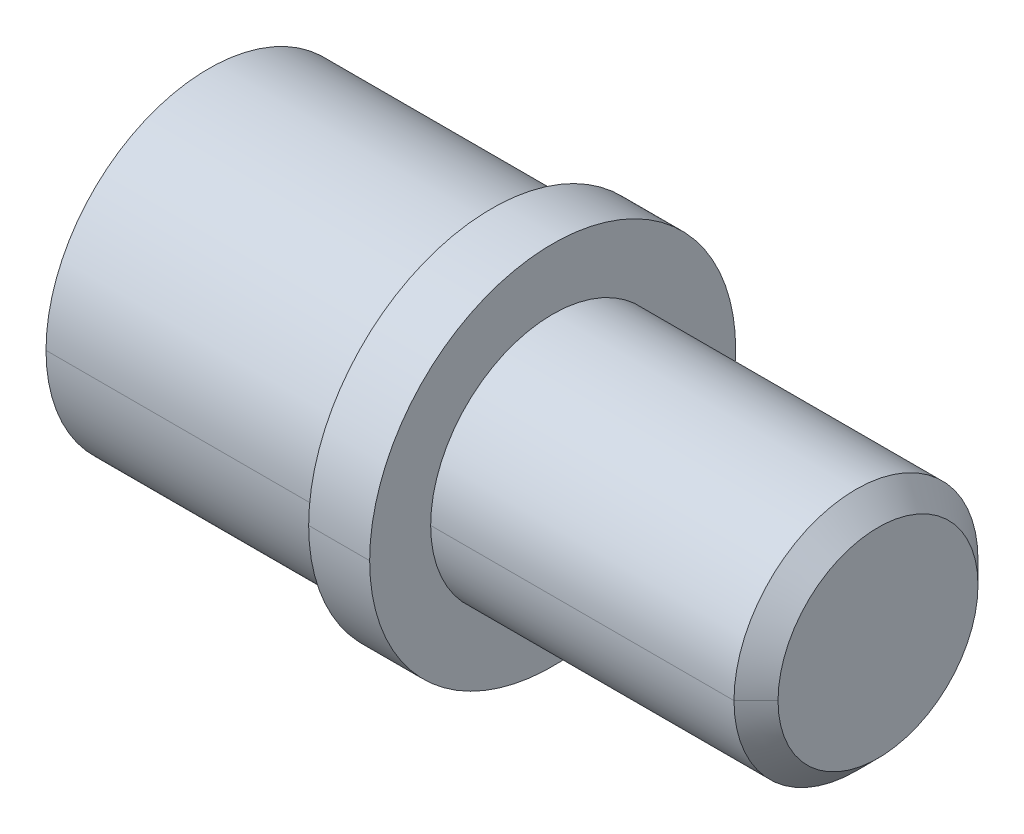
ISO-10303-21;
HEADER;
FILE_DESCRIPTION(('STEP AP214'),'2;1');
FILE_NAME('part.step','',(''),(''),'','','');
FILE_SCHEMA(('AUTOMOTIVE_DESIGN { 1 0 10303 214 1 1 1 1 }'));
ENDSEC;
DATA;
#1=APPLICATION_CONTEXT('core data for automotive mechanical design processes');
#2=APPLICATION_PROTOCOL_DEFINITION('international standard','automotive_design',2000,#1);
#3=PRODUCT_CONTEXT('',#1,'mechanical');
#4=PRODUCT('Part','Part','',(#3));
#5=PRODUCT_RELATED_PRODUCT_CATEGORY('part','',(#4));
#6=PRODUCT_DEFINITION_FORMATION('','',#4);
#7=PRODUCT_DEFINITION_CONTEXT('part definition',#1,'design');
#8=PRODUCT_DEFINITION('design','',#6,#7);
#9=PRODUCT_DEFINITION_SHAPE('','',#8);
#10=(LENGTH_UNIT() NAMED_UNIT(*) SI_UNIT(.MILLI.,.METRE.));
#11=(NAMED_UNIT(*) PLANE_ANGLE_UNIT() SI_UNIT($,.RADIAN.));
#12=(NAMED_UNIT(*) SI_UNIT($,.STERADIAN.) SOLID_ANGLE_UNIT());
#13=UNCERTAINTY_MEASURE_WITH_UNIT(LENGTH_MEASURE(1.E-05),#10,'distance_accuracy_value','');
#14=(GEOMETRIC_REPRESENTATION_CONTEXT(3) GLOBAL_UNCERTAINTY_ASSIGNED_CONTEXT((#13)) GLOBAL_UNIT_ASSIGNED_CONTEXT((#10,
#11,#12)) REPRESENTATION_CONTEXT('',''));
#15=CARTESIAN_POINT('',(0.,0.,0.));
#16=DIRECTION('',(0.,0.,1.));
#17=DIRECTION('',(1.,0.,0.));
#18=AXIS2_PLACEMENT_3D('',#15,#16,#17);
#19=CARTESIAN_POINT('',(-2.25,0.,0.));
#20=DIRECTION('',(-1.,0.,0.));
#21=DIRECTION('',(0.,1.,0.));
#22=AXIS2_PLACEMENT_3D('',#19,#20,#21);
#23=CONICAL_SURFACE('',#22,2.875,1.0471975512);
#24=DIRECTION('',(-0.499999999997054,0.,-0.86602540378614));
#25=VECTOR('',#24,1.);
#26=CARTESIAN_POINT('',(-0.590117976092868,0.,0.));
#27=LINE('',#26,#25);
#28=CARTESIAN_POINT('',(-0.59011797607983,0.,0.));
#29=VERTEX_POINT('',#28);
#30=CARTESIAN_POINT('',(-2.25,0.,-2.875));
#31=VERTEX_POINT('',#30);
#32=EDGE_CURVE('E11',#29,#31,#27,.T.);
#33=ORIENTED_EDGE('',*,*,#32,.T.);
#34=CARTESIAN_POINT('',(-2.25,0.,0.));
#35=DIRECTION('',(1.,0.,0.));
#36=DIRECTION('',(0.,0.,-1.));
#37=AXIS2_PLACEMENT_3D('',#34,#35,#36);
#38=CIRCLE('',#37,2.875);
#39=CARTESIAN_POINT('',(-2.25,-1.41972708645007,-2.5));
#40=VERTEX_POINT('',#39);
#41=EDGE_CURVE('E24',#40,#31,#38,.T.);
#42=ORIENTED_EDGE('',*,*,#41,.F.);
#43=CARTESIAN_POINT('',(-2.25,0.,0.));
#44=DIRECTION('',(1.,0.,0.));
#45=DIRECTION('',(0.,0.,-1.));
#46=AXIS2_PLACEMENT_3D('',#43,#44,#45);
#47=CIRCLE('',#46,2.875);
#48=CARTESIAN_POINT('',(-2.25,-1.45519996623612,-2.47951972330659));
#49=VERTEX_POINT('',#48);
#50=EDGE_CURVE('E518',#49,#40,#47,.T.);
#51=ORIENTED_EDGE('',*,*,#50,.F.);
#52=CARTESIAN_POINT('',(-2.25,0.,0.));
#53=DIRECTION('',(1.,0.,0.));
#54=DIRECTION('',(0.,0.,-1.));
#55=AXIS2_PLACEMENT_3D('',#52,#53,#54);
#56=CIRCLE('',#55,2.875);
#57=CARTESIAN_POINT('',(-2.25,-2.87492705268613,-0.0204802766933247));
#58=VERTEX_POINT('',#57);
#59=EDGE_CURVE('E513',#58,#49,#56,.T.);
#60=ORIENTED_EDGE('',*,*,#59,.F.);
#61=CARTESIAN_POINT('',(-2.25,0.,0.));
#62=DIRECTION('',(1.,0.,0.));
#63=DIRECTION('',(0.,0.,-1.));
#64=AXIS2_PLACEMENT_3D('',#61,#62,#63);
#65=CIRCLE('',#64,2.875);
#66=CARTESIAN_POINT('',(-2.25,-2.87492705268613,0.0204802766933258));
#67=VERTEX_POINT('',#66);
#68=EDGE_CURVE('E508',#67,#58,#65,.T.);
#69=ORIENTED_EDGE('',*,*,#68,.F.);
#70=CARTESIAN_POINT('',(-2.25,0.,0.));
#71=DIRECTION('',(1.,0.,0.));
#72=DIRECTION('',(0.,0.,-1.));
#73=AXIS2_PLACEMENT_3D('',#70,#71,#72);
#74=CIRCLE('',#73,2.875);
#75=CARTESIAN_POINT('',(-2.25,-1.45519996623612,2.47951972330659));
#76=VERTEX_POINT('',#75);
#77=EDGE_CURVE('E503',#76,#67,#74,.T.);
#78=ORIENTED_EDGE('',*,*,#77,.F.);
#79=CARTESIAN_POINT('',(-2.25,0.,0.));
#80=DIRECTION('',(1.,0.,0.));
#81=DIRECTION('',(0.,0.,-1.));
#82=AXIS2_PLACEMENT_3D('',#79,#80,#81);
#83=CIRCLE('',#82,2.875);
#84=CARTESIAN_POINT('',(-2.25,-1.41972708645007,2.5));
#85=VERTEX_POINT('',#84);
#86=EDGE_CURVE('E498',#85,#76,#83,.T.);
#87=ORIENTED_EDGE('',*,*,#86,.F.);
#88=CARTESIAN_POINT('',(-2.25,0.,0.));
#89=DIRECTION('',(1.,0.,0.));
#90=DIRECTION('',(0.,0.,-1.));
#91=AXIS2_PLACEMENT_3D('',#88,#89,#90);
#92=CIRCLE('',#91,2.875);
#93=CARTESIAN_POINT('',(-2.25,0.,2.875));
#94=VERTEX_POINT('',#93);
#95=EDGE_CURVE('E493',#94,#85,#92,.T.);
#96=ORIENTED_EDGE('',*,*,#95,.F.);
#97=DIRECTION('',(-0.499999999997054,0.,0.86602540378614));
#98=VECTOR('',#97,1.);
#99=CARTESIAN_POINT('',(-0.590117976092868,0.,0.));
#100=LINE('',#99,#98);
#101=EDGE_CURVE('E488',#29,#94,#100,.T.);
#102=ORIENTED_EDGE('',*,*,#101,.F.);
#103=EDGE_LOOP('',(#33,#42,#51,#60,#69,#78,#87,#96,#102));
#104=FACE_BOUND('',#103,.T.);
#105=ADVANCED_FACE('F16',(#104),#23,.F.);
#106=CARTESIAN_POINT('',(-2.25,0.,0.));
#107=DIRECTION('',(-1.,0.,0.));
#108=DIRECTION('',(0.,-1.,0.));
#109=AXIS2_PLACEMENT_3D('',#106,#107,#108);
#110=CONICAL_SURFACE('',#109,2.875,1.0471975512);
#111=ORIENTED_EDGE('',*,*,#101,.T.);
#112=CARTESIAN_POINT('',(-2.25,0.,0.));
#113=DIRECTION('',(1.,0.,0.));
#114=DIRECTION('',(0.,0.,-1.));
#115=AXIS2_PLACEMENT_3D('',#112,#113,#114);
#116=CIRCLE('',#115,2.875);
#117=CARTESIAN_POINT('',(-2.25,1.41972708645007,2.5));
#118=VERTEX_POINT('',#117);
#119=EDGE_CURVE('E483',#118,#94,#116,.T.);
#120=ORIENTED_EDGE('',*,*,#119,.F.);
#121=CARTESIAN_POINT('',(-2.25,0.,0.));
#122=DIRECTION('',(1.,0.,0.));
#123=DIRECTION('',(0.,0.,-1.));
#124=AXIS2_PLACEMENT_3D('',#121,#122,#123);
#125=CIRCLE('',#124,2.875);
#126=CARTESIAN_POINT('',(-2.25,1.45519996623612,2.47951972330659));
#127=VERTEX_POINT('',#126);
#128=EDGE_CURVE('E478',#127,#118,#125,.T.);
#129=ORIENTED_EDGE('',*,*,#128,.F.);
#130=CARTESIAN_POINT('',(-2.25,0.,0.));
#131=DIRECTION('',(1.,0.,0.));
#132=DIRECTION('',(0.,0.,-1.));
#133=AXIS2_PLACEMENT_3D('',#130,#131,#132);
#134=CIRCLE('',#133,2.875);
#135=CARTESIAN_POINT('',(-2.25,2.87492705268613,0.0204802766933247));
#136=VERTEX_POINT('',#135);
#137=EDGE_CURVE('E473',#136,#127,#134,.T.);
#138=ORIENTED_EDGE('',*,*,#137,.F.);
#139=CARTESIAN_POINT('',(-2.25,0.,0.));
#140=DIRECTION('',(1.,0.,0.));
#141=DIRECTION('',(0.,0.,-1.));
#142=AXIS2_PLACEMENT_3D('',#139,#140,#141);
#143=CIRCLE('',#142,2.875);
#144=CARTESIAN_POINT('',(-2.25,2.87492705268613,-0.0204802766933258));
#145=VERTEX_POINT('',#144);
#146=EDGE_CURVE('E468',#145,#136,#143,.T.);
#147=ORIENTED_EDGE('',*,*,#146,.F.);
#148=CARTESIAN_POINT('',(-2.25,0.,0.));
#149=DIRECTION('',(1.,0.,0.));
#150=DIRECTION('',(0.,0.,-1.));
#151=AXIS2_PLACEMENT_3D('',#148,#149,#150);
#152=CIRCLE('',#151,2.875);
#153=CARTESIAN_POINT('',(-2.25,1.45519996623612,-2.47951972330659));
#154=VERTEX_POINT('',#153);
#155=EDGE_CURVE('E463',#154,#145,#152,.T.);
#156=ORIENTED_EDGE('',*,*,#155,.F.);
#157=CARTESIAN_POINT('',(-2.25,0.,0.));
#158=DIRECTION('',(1.,0.,0.));
#159=DIRECTION('',(0.,0.,-1.));
#160=AXIS2_PLACEMENT_3D('',#157,#158,#159);
#161=CIRCLE('',#160,2.875);
#162=CARTESIAN_POINT('',(-2.25,1.41972708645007,-2.5));
#163=VERTEX_POINT('',#162);
#164=EDGE_CURVE('E458',#163,#154,#161,.T.);
#165=ORIENTED_EDGE('',*,*,#164,.F.);
#166=CARTESIAN_POINT('',(-2.25,0.,0.));
#167=DIRECTION('',(1.,0.,0.));
#168=DIRECTION('',(0.,0.,-1.));
#169=AXIS2_PLACEMENT_3D('',#166,#167,#168);
#170=CIRCLE('',#169,2.875);
#171=EDGE_CURVE('E453',#31,#163,#170,.T.);
#172=ORIENTED_EDGE('',*,*,#171,.F.);
#173=ORIENTED_EDGE('',*,*,#32,.F.);
#174=EDGE_LOOP('',(#111,#120,#129,#138,#147,#156,#165,#172,#173));
#175=FACE_BOUND('',#174,.T.);
#176=ADVANCED_FACE('F567',(#175),#110,.F.);
#177=CARTESIAN_POINT('',(-2.25,0.,0.));
#178=DIRECTION('',(1.,0.,0.));
#179=DIRECTION('',(0.,0.,-1.));
#180=AXIS2_PLACEMENT_3D('',#177,#178,#179);
#181=PLANE('',#180);
#182=ORIENTED_EDGE('',*,*,#41,.T.);
#183=ORIENTED_EDGE('',*,*,#171,.T.);
#184=DIRECTION('',(0.,1.,0.));
#185=VECTOR('',#184,1.);
#186=CARTESIAN_POINT('',(-2.25,-1.4433756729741,-2.5));
#187=LINE('',#186,#185);
#188=EDGE_CURVE('E448',#40,#163,#187,.T.);
#189=ORIENTED_EDGE('',*,*,#188,.F.);
#190=EDGE_LOOP('',(#182,#183,#189));
#191=FACE_BOUND('',#190,.T.);
#192=ADVANCED_FACE('F528',(#191),#181,.T.);
#193=CARTESIAN_POINT('',(-2.25,-1.4433756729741,-2.5));
#194=DIRECTION('',(0.,0.,1.));
#195=DIRECTION('',(1.,0.,0.));
#196=AXIS2_PLACEMENT_3D('',#193,#194,#195);
#197=PLANE('',#196);
#198=DIRECTION('',(0.,-1.,0.));
#199=VECTOR('',#198,1.);
#200=CARTESIAN_POINT('',(-3.6,0.,-2.5));
#201=LINE('',#200,#199);
#202=CARTESIAN_POINT('',(-3.6,1.4433756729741,-2.5));
#203=VERTEX_POINT('',#202);
#204=CARTESIAN_POINT('',(-3.6,-1.4433756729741,-2.5));
#205=VERTEX_POINT('',#204);
#206=EDGE_CURVE('E444',#203,#205,#201,.T.);
#207=ORIENTED_EDGE('',*,*,#206,.T.);
#208=DIRECTION('',(-1.,0.,0.));
#209=VECTOR('',#208,1.);
#210=CARTESIAN_POINT('',(-2.25,-1.4433756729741,-2.5));
#211=LINE('',#210,#209);
#212=CARTESIAN_POINT('',(-2.25,-1.4433756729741,-2.5));
#213=VERTEX_POINT('',#212);
#214=EDGE_CURVE('E439',#213,#205,#211,.T.);
#215=ORIENTED_EDGE('',*,*,#214,.F.);
#216=DIRECTION('',(0.,1.,0.));
#217=VECTOR('',#216,1.);
#218=CARTESIAN_POINT('',(-2.25,-1.4433756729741,-2.5));
#219=LINE('',#218,#217);
#220=EDGE_CURVE('E434',#213,#40,#219,.T.);
#221=ORIENTED_EDGE('',*,*,#220,.T.);
#222=ORIENTED_EDGE('',*,*,#188,.T.);
#223=DIRECTION('',(0.,1.,0.));
#224=VECTOR('',#223,1.);
#225=CARTESIAN_POINT('',(-2.25,-1.4433756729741,-2.5));
#226=LINE('',#225,#224);
#227=CARTESIAN_POINT('',(-2.25,1.4433756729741,-2.5));
#228=VERTEX_POINT('',#227);
#229=EDGE_CURVE('E430',#163,#228,#226,.T.);
#230=ORIENTED_EDGE('',*,*,#229,.T.);
#231=DIRECTION('',(-1.,0.,0.));
#232=VECTOR('',#231,1.);
#233=CARTESIAN_POINT('',(-2.25,1.4433756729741,-2.5));
#234=LINE('',#233,#232);
#235=EDGE_CURVE('E426',#228,#203,#234,.T.);
#236=ORIENTED_EDGE('',*,*,#235,.T.);
#237=EDGE_LOOP('',(#207,#215,#221,#222,#230,#236));
#238=FACE_BOUND('',#237,.T.);
#239=ADVANCED_FACE('F532',(#238),#197,.T.);
#240=CARTESIAN_POINT('',(-2.25,1.4433756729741,-2.5));
#241=DIRECTION('',(0.,-0.866025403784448,0.499999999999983));
#242=DIRECTION('',(0.,-0.499999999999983,-0.866025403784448));
#243=AXIS2_PLACEMENT_3D('',#240,#241,#242);
#244=PLANE('',#243);
#245=DIRECTION('',(0.,-0.499999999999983,-0.866025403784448));
#246=VECTOR('',#245,1.);
#247=CARTESIAN_POINT('',(-3.6,2.16506350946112,-1.24999999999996));
#248=LINE('',#247,#246);
#249=CARTESIAN_POINT('',(-3.6,2.8867513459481,0.));
#250=VERTEX_POINT('',#249);
#251=EDGE_CURVE('E421',#250,#203,#248,.T.);
#252=ORIENTED_EDGE('',*,*,#251,.T.);
#253=ORIENTED_EDGE('',*,*,#235,.F.);
#254=DIRECTION('',(0.,0.499999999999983,0.866025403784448));
#255=VECTOR('',#254,1.);
#256=CARTESIAN_POINT('',(-2.25,1.4433756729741,-2.5));
#257=LINE('',#256,#255);
#258=EDGE_CURVE('E416',#228,#154,#257,.T.);
#259=ORIENTED_EDGE('',*,*,#258,.T.);
#260=DIRECTION('',(0.,0.499999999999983,0.866025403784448));
#261=VECTOR('',#260,1.);
#262=CARTESIAN_POINT('',(-2.25,1.4433756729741,-2.5));
#263=LINE('',#262,#261);
#264=EDGE_CURVE('E411',#154,#145,#263,.T.);
#265=ORIENTED_EDGE('',*,*,#264,.T.);
#266=DIRECTION('',(0.,0.499999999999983,0.866025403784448));
#267=VECTOR('',#266,1.);
#268=CARTESIAN_POINT('',(-2.25,1.4433756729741,-2.5));
#269=LINE('',#268,#267);
#270=CARTESIAN_POINT('',(-2.25,2.8867513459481,0.));
#271=VERTEX_POINT('',#270);
#272=EDGE_CURVE('E407',#145,#271,#269,.T.);
#273=ORIENTED_EDGE('',*,*,#272,.T.);
#274=DIRECTION('',(-1.,0.,0.));
#275=VECTOR('',#274,1.);
#276=CARTESIAN_POINT('',(-2.25,2.8867513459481,0.));
#277=LINE('',#276,#275);
#278=EDGE_CURVE('E403',#271,#250,#277,.T.);
#279=ORIENTED_EDGE('',*,*,#278,.T.);
#280=EDGE_LOOP('',(#252,#253,#259,#265,#273,#279));
#281=FACE_BOUND('',#280,.T.);
#282=ADVANCED_FACE('F580',(#281),#244,.T.);
#283=CARTESIAN_POINT('',(-2.25,2.8867513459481,0.));
#284=DIRECTION('',(0.,-0.866025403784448,-0.499999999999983));
#285=DIRECTION('',(0.,0.499999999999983,-0.866025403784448));
#286=AXIS2_PLACEMENT_3D('',#283,#284,#285);
#287=PLANE('',#286);
#288=DIRECTION('',(0.,0.499999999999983,-0.866025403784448));
#289=VECTOR('',#288,1.);
#290=CARTESIAN_POINT('',(-3.6,2.16506350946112,1.24999999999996));
#291=LINE('',#290,#289);
#292=CARTESIAN_POINT('',(-3.6,1.4433756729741,2.5));
#293=VERTEX_POINT('',#292);
#294=EDGE_CURVE('E398',#293,#250,#291,.T.);
#295=ORIENTED_EDGE('',*,*,#294,.T.);
#296=ORIENTED_EDGE('',*,*,#278,.F.);
#297=DIRECTION('',(0.,-0.499999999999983,0.866025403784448));
#298=VECTOR('',#297,1.);
#299=CARTESIAN_POINT('',(-2.25,2.8867513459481,0.));
#300=LINE('',#299,#298);
#301=EDGE_CURVE('E393',#271,#136,#300,.T.);
#302=ORIENTED_EDGE('',*,*,#301,.T.);
#303=DIRECTION('',(0.,-0.499999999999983,0.866025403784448));
#304=VECTOR('',#303,1.);
#305=CARTESIAN_POINT('',(-2.25,2.8867513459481,0.));
#306=LINE('',#305,#304);
#307=EDGE_CURVE('E388',#136,#127,#306,.T.);
#308=ORIENTED_EDGE('',*,*,#307,.T.);
#309=DIRECTION('',(0.,-0.499999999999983,0.866025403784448));
#310=VECTOR('',#309,1.);
#311=CARTESIAN_POINT('',(-2.25,2.8867513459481,0.));
#312=LINE('',#311,#310);
#313=CARTESIAN_POINT('',(-2.25,1.4433756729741,2.5));
#314=VERTEX_POINT('',#313);
#315=EDGE_CURVE('E384',#127,#314,#312,.T.);
#316=ORIENTED_EDGE('',*,*,#315,.T.);
#317=DIRECTION('',(-1.,0.,0.));
#318=VECTOR('',#317,1.);
#319=CARTESIAN_POINT('',(-2.25,1.4433756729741,2.5));
#320=LINE('',#319,#318);
#321=EDGE_CURVE('E380',#314,#293,#320,.T.);
#322=ORIENTED_EDGE('',*,*,#321,.T.);
#323=EDGE_LOOP('',(#295,#296,#302,#308,#316,#322));
#324=FACE_BOUND('',#323,.T.);
#325=ADVANCED_FACE('F570',(#324),#287,.T.);
#326=CARTESIAN_POINT('',(-2.25,1.4433756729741,2.5));
#327=DIRECTION('',(0.,0.,-1.));
#328=DIRECTION('',(-1.,0.,0.));
#329=AXIS2_PLACEMENT_3D('',#326,#327,#328);
#330=PLANE('',#329);
#331=DIRECTION('',(0.,1.,0.));
#332=VECTOR('',#331,1.);
#333=CARTESIAN_POINT('',(-3.6,0.,2.5));
#334=LINE('',#333,#332);
#335=CARTESIAN_POINT('',(-3.6,-1.4433756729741,2.5));
#336=VERTEX_POINT('',#335);
#337=EDGE_CURVE('E375',#336,#293,#334,.T.);
#338=ORIENTED_EDGE('',*,*,#337,.T.);
#339=ORIENTED_EDGE('',*,*,#321,.F.);
#340=DIRECTION('',(0.,-1.,0.));
#341=VECTOR('',#340,1.);
#342=CARTESIAN_POINT('',(-2.25,1.4433756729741,2.5));
#343=LINE('',#342,#341);
#344=EDGE_CURVE('E370',#314,#118,#343,.T.);
#345=ORIENTED_EDGE('',*,*,#344,.T.);
#346=DIRECTION('',(0.,-1.,0.));
#347=VECTOR('',#346,1.);
#348=CARTESIAN_POINT('',(-2.25,1.4433756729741,2.5));
#349=LINE('',#348,#347);
#350=EDGE_CURVE('E365',#118,#85,#349,.T.);
#351=ORIENTED_EDGE('',*,*,#350,.T.);
#352=DIRECTION('',(0.,-1.,0.));
#353=VECTOR('',#352,1.);
#354=CARTESIAN_POINT('',(-2.25,1.4433756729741,2.5));
#355=LINE('',#354,#353);
#356=CARTESIAN_POINT('',(-2.25,-1.4433756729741,2.5));
#357=VERTEX_POINT('',#356);
#358=EDGE_CURVE('E361',#85,#357,#355,.T.);
#359=ORIENTED_EDGE('',*,*,#358,.T.);
#360=DIRECTION('',(-1.,0.,0.));
#361=VECTOR('',#360,1.);
#362=CARTESIAN_POINT('',(-2.25,-1.4433756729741,2.5));
#363=LINE('',#362,#361);
#364=EDGE_CURVE('E357',#357,#336,#363,.T.);
#365=ORIENTED_EDGE('',*,*,#364,.T.);
#366=EDGE_LOOP('',(#338,#339,#345,#351,#359,#365));
#367=FACE_BOUND('',#366,.T.);
#368=ADVANCED_FACE('F558',(#367),#330,.T.);
#369=CARTESIAN_POINT('',(-2.25,-1.4433756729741,2.5));
#370=DIRECTION('',(0.,0.866025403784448,-0.499999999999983));
#371=DIRECTION('',(0.,0.499999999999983,0.866025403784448));
#372=AXIS2_PLACEMENT_3D('',#369,#370,#371);
#373=PLANE('',#372);
#374=DIRECTION('',(0.,0.499999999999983,0.866025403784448));
#375=VECTOR('',#374,1.);
#376=CARTESIAN_POINT('',(-3.6,-2.16506350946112,1.24999999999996));
#377=LINE('',#376,#375);
#378=CARTESIAN_POINT('',(-3.6,-2.8867513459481,0.));
#379=VERTEX_POINT('',#378);
#380=EDGE_CURVE('E352',#379,#336,#377,.T.);
#381=ORIENTED_EDGE('',*,*,#380,.T.);
#382=ORIENTED_EDGE('',*,*,#364,.F.);
#383=DIRECTION('',(0.,-0.499999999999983,-0.866025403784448));
#384=VECTOR('',#383,1.);
#385=CARTESIAN_POINT('',(-2.25,-1.4433756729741,2.5));
#386=LINE('',#385,#384);
#387=EDGE_CURVE('E347',#357,#76,#386,.T.);
#388=ORIENTED_EDGE('',*,*,#387,.T.);
#389=DIRECTION('',(0.,-0.499999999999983,-0.866025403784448));
#390=VECTOR('',#389,1.);
#391=CARTESIAN_POINT('',(-2.25,-1.4433756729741,2.5));
#392=LINE('',#391,#390);
#393=EDGE_CURVE('E342',#76,#67,#392,.T.);
#394=ORIENTED_EDGE('',*,*,#393,.T.);
#395=DIRECTION('',(0.,-0.499999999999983,-0.866025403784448));
#396=VECTOR('',#395,1.);
#397=CARTESIAN_POINT('',(-2.25,-1.4433756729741,2.5));
#398=LINE('',#397,#396);
#399=CARTESIAN_POINT('',(-2.25,-2.8867513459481,0.));
#400=VERTEX_POINT('',#399);
#401=EDGE_CURVE('E338',#67,#400,#398,.T.);
#402=ORIENTED_EDGE('',*,*,#401,.T.);
#403=DIRECTION('',(-1.,0.,0.));
#404=VECTOR('',#403,1.);
#405=CARTESIAN_POINT('',(-2.25,-2.8867513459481,0.));
#406=LINE('',#405,#404);
#407=EDGE_CURVE('E334',#400,#379,#406,.T.);
#408=ORIENTED_EDGE('',*,*,#407,.T.);
#409=EDGE_LOOP('',(#381,#382,#388,#394,#402,#408));
#410=FACE_BOUND('',#409,.T.);
#411=ADVANCED_FACE('F548',(#410),#373,.T.);
#412=CARTESIAN_POINT('',(-2.25,-2.8867513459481,0.));
#413=DIRECTION('',(0.,0.866025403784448,0.499999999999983));
#414=DIRECTION('',(0.,-0.499999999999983,0.866025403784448));
#415=AXIS2_PLACEMENT_3D('',#412,#413,#414);
#416=PLANE('',#415);
#417=DIRECTION('',(0.,-0.499999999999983,0.866025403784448));
#418=VECTOR('',#417,1.);
#419=CARTESIAN_POINT('',(-3.6,-2.16506350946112,-1.24999999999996));
#420=LINE('',#419,#418);
#421=EDGE_CURVE('E329',#205,#379,#420,.T.);
#422=ORIENTED_EDGE('',*,*,#421,.T.);
#423=ORIENTED_EDGE('',*,*,#407,.F.);
#424=DIRECTION('',(0.,0.499999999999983,-0.866025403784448));
#425=VECTOR('',#424,1.);
#426=CARTESIAN_POINT('',(-2.25,-2.8867513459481,0.));
#427=LINE('',#426,#425);
#428=EDGE_CURVE('E324',#400,#58,#427,.T.);
#429=ORIENTED_EDGE('',*,*,#428,.T.);
#430=DIRECTION('',(0.,0.499999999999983,-0.866025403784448));
#431=VECTOR('',#430,1.);
#432=CARTESIAN_POINT('',(-2.25,-2.8867513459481,0.));
#433=LINE('',#432,#431);
#434=EDGE_CURVE('E319',#58,#49,#433,.T.);
#435=ORIENTED_EDGE('',*,*,#434,.T.);
#436=DIRECTION('',(0.,0.499999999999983,-0.866025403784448));
#437=VECTOR('',#436,1.);
#438=CARTESIAN_POINT('',(-2.25,-2.8867513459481,0.));
#439=LINE('',#438,#437);
#440=EDGE_CURVE('E314',#49,#213,#439,.T.);
#441=ORIENTED_EDGE('',*,*,#440,.T.);
#442=ORIENTED_EDGE('',*,*,#214,.T.);
#443=EDGE_LOOP('',(#422,#423,#429,#435,#441,#442));
#444=FACE_BOUND('',#443,.T.);
#445=ADVANCED_FACE('F538',(#444),#416,.T.);
#446=CARTESIAN_POINT('',(-2.25,0.,0.));
#447=DIRECTION('',(1.,0.,0.));
#448=DIRECTION('',(0.,0.,-1.));
#449=AXIS2_PLACEMENT_3D('',#446,#447,#448);
#450=PLANE('',#449);
#451=ORIENTED_EDGE('',*,*,#50,.T.);
#452=ORIENTED_EDGE('',*,*,#220,.F.);
#453=ORIENTED_EDGE('',*,*,#440,.F.);
#454=EDGE_LOOP('',(#451,#452,#453));
#455=FACE_BOUND('',#454,.T.);
#456=ADVANCED_FACE('F535',(#455),#450,.F.);
#457=CARTESIAN_POINT('',(-2.25,0.,0.));
#458=DIRECTION('',(1.,0.,0.));
#459=DIRECTION('',(0.,0.,-1.));
#460=AXIS2_PLACEMENT_3D('',#457,#458,#459);
#461=PLANE('',#460);
#462=ORIENTED_EDGE('',*,*,#59,.T.);
#463=ORIENTED_EDGE('',*,*,#434,.F.);
#464=EDGE_LOOP('',(#462,#463));
#465=FACE_BOUND('',#464,.T.);
#466=ADVANCED_FACE('F542',(#465),#461,.T.);
#467=CARTESIAN_POINT('',(-2.25,0.,0.));
#468=DIRECTION('',(1.,0.,0.));
#469=DIRECTION('',(0.,0.,-1.));
#470=AXIS2_PLACEMENT_3D('',#467,#468,#469);
#471=PLANE('',#470);
#472=ORIENTED_EDGE('',*,*,#68,.T.);
#473=ORIENTED_EDGE('',*,*,#428,.F.);
#474=ORIENTED_EDGE('',*,*,#401,.F.);
#475=EDGE_LOOP('',(#472,#473,#474));
#476=FACE_BOUND('',#475,.T.);
#477=ADVANCED_FACE('F545',(#476),#471,.F.);
#478=CARTESIAN_POINT('',(-3.6,0.,0.));
#479=DIRECTION('',(1.,0.,0.));
#480=DIRECTION('',(0.,0.,-1.));
#481=AXIS2_PLACEMENT_3D('',#478,#479,#480);
#482=PLANE('',#481);
#483=CARTESIAN_POINT('',(-3.6,0.,0.));
#484=DIRECTION('',(1.,0.,0.));
#485=DIRECTION('',(0.,0.,-1.));
#486=AXIS2_PLACEMENT_3D('',#483,#484,#485);
#487=CIRCLE('',#486,3.5);
#488=CARTESIAN_POINT('',(-3.6,0.,-3.5));
#489=VERTEX_POINT('',#488);
#490=CARTESIAN_POINT('',(-3.6,0.,3.5));
#491=VERTEX_POINT('',#490);
#492=EDGE_CURVE('E309',#489,#491,#487,.T.);
#493=ORIENTED_EDGE('',*,*,#492,.F.);
#494=CARTESIAN_POINT('',(-3.6,0.,0.));
#495=DIRECTION('',(1.,0.,0.));
#496=DIRECTION('',(0.,0.,-1.));
#497=AXIS2_PLACEMENT_3D('',#494,#495,#496);
#498=CIRCLE('',#497,3.5);
#499=EDGE_CURVE('E304',#491,#489,#498,.T.);
#500=ORIENTED_EDGE('',*,*,#499,.F.);
#501=EDGE_LOOP('',(#493,#500));
#502=FACE_BOUND('',#501,.T.);
#503=ORIENTED_EDGE('',*,*,#337,.F.);
#504=ORIENTED_EDGE('',*,*,#380,.F.);
#505=ORIENTED_EDGE('',*,*,#421,.F.);
#506=ORIENTED_EDGE('',*,*,#206,.F.);
#507=ORIENTED_EDGE('',*,*,#251,.F.);
#508=ORIENTED_EDGE('',*,*,#294,.F.);
#509=EDGE_LOOP('',(#503,#504,#505,#506,#507,#508));
#510=FACE_BOUND('',#509,.T.);
#511=ADVANCED_FACE('F593',(#502,#510),#482,.F.);
#512=CARTESIAN_POINT('',(13.,0.,0.));
#513=DIRECTION('',(-1.,0.,0.));
#514=DIRECTION('',(0.,1.,0.));
#515=AXIS2_PLACEMENT_3D('',#512,#513,#514);
#516=CYLINDRICAL_SURFACE('',#515,3.5);
#517=ORIENTED_EDGE('',*,*,#499,.T.);
#518=DIRECTION('',(-1.,0.,0.));
#519=VECTOR('',#518,1.);
#520=CARTESIAN_POINT('',(-3.25,0.,-3.5));
#521=LINE('',#520,#519);
#522=CARTESIAN_POINT('',(-3.25,0.,-3.5));
#523=VERTEX_POINT('',#522);
#524=EDGE_CURVE('E299',#523,#489,#521,.T.);
#525=ORIENTED_EDGE('',*,*,#524,.F.);
#526=CARTESIAN_POINT('',(-3.25,0.,0.));
#527=DIRECTION('',(1.,0.,0.));
#528=DIRECTION('',(0.,0.,-1.));
#529=AXIS2_PLACEMENT_3D('',#526,#527,#528);
#530=CIRCLE('',#529,3.5);
#531=CARTESIAN_POINT('',(-3.25,0.,3.5));
#532=VERTEX_POINT('',#531);
#533=EDGE_CURVE('E294',#532,#523,#530,.T.);
#534=ORIENTED_EDGE('',*,*,#533,.F.);
#535=DIRECTION('',(-1.,0.,0.));
#536=VECTOR('',#535,1.);
#537=CARTESIAN_POINT('',(-3.25,0.,3.5));
#538=LINE('',#537,#536);
#539=EDGE_CURVE('E289',#532,#491,#538,.T.);
#540=ORIENTED_EDGE('',*,*,#539,.T.);
#541=EDGE_LOOP('',(#517,#525,#534,#540));
#542=FACE_BOUND('',#541,.T.);
#543=ADVANCED_FACE('F596',(#542),#516,.T.);
#544=CARTESIAN_POINT('',(13.,0.,0.));
#545=DIRECTION('',(-1.,0.,0.));
#546=DIRECTION('',(0.,-1.,0.));
#547=AXIS2_PLACEMENT_3D('',#544,#545,#546);
#548=CYLINDRICAL_SURFACE('',#547,3.5);
#549=CARTESIAN_POINT('',(-3.25,0.,0.));
#550=DIRECTION('',(1.,0.,0.));
#551=DIRECTION('',(0.,0.,-1.));
#552=AXIS2_PLACEMENT_3D('',#549,#550,#551);
#553=CIRCLE('',#552,3.5);
#554=EDGE_CURVE('E284',#523,#532,#553,.T.);
#555=ORIENTED_EDGE('',*,*,#554,.F.);
#556=ORIENTED_EDGE('',*,*,#524,.T.);
#557=ORIENTED_EDGE('',*,*,#492,.T.);
#558=ORIENTED_EDGE('',*,*,#539,.F.);
#559=EDGE_LOOP('',(#555,#556,#557,#558));
#560=FACE_BOUND('',#559,.T.);
#561=ADVANCED_FACE('F604',(#560),#548,.T.);
#562=CARTESIAN_POINT('',(-3.25,0.,0.));
#563=DIRECTION('',(-1.,0.,0.));
#564=DIRECTION('',(0.,-1.,0.));
#565=AXIS2_PLACEMENT_3D('',#562,#563,#564);
#566=CONICAL_SURFACE('',#565,3.5,1.1760052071);
#567=ORIENTED_EDGE('',*,*,#554,.T.);
#568=DIRECTION('',(-0.384615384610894,0.,0.923076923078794));
#569=VECTOR('',#568,1.);
#570=CARTESIAN_POINT('',(-3.25,0.,3.5));
#571=LINE('',#570,#569);
#572=CARTESIAN_POINT('',(-3.4583333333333,0.,4.));
#573=VERTEX_POINT('',#572);
#574=EDGE_CURVE('E280',#532,#573,#571,.T.);
#575=ORIENTED_EDGE('',*,*,#574,.T.);
#576=CARTESIAN_POINT('',(-3.4583333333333,0.,0.));
#577=DIRECTION('',(1.,0.,0.));
#578=DIRECTION('',(0.,0.,-1.));
#579=AXIS2_PLACEMENT_3D('',#576,#577,#578);
#580=CIRCLE('',#579,4.);
#581=CARTESIAN_POINT('',(-3.4583333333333,0.,-4.));
#582=VERTEX_POINT('',#581);
#583=EDGE_CURVE('E275',#582,#573,#580,.T.);
#584=ORIENTED_EDGE('',*,*,#583,.F.);
#585=DIRECTION('',(-0.384615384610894,0.,-0.923076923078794));
#586=VECTOR('',#585,1.);
#587=CARTESIAN_POINT('',(-3.25,0.,-3.5));
#588=LINE('',#587,#586);
#589=EDGE_CURVE('E270',#523,#582,#588,.T.);
#590=ORIENTED_EDGE('',*,*,#589,.F.);
#591=EDGE_LOOP('',(#567,#575,#584,#590));
#592=FACE_BOUND('',#591,.T.);
#593=ADVANCED_FACE('F664',(#592),#566,.F.);
#594=CARTESIAN_POINT('',(-3.25,0.,0.));
#595=DIRECTION('',(-1.,0.,0.));
#596=DIRECTION('',(0.,1.,0.));
#597=AXIS2_PLACEMENT_3D('',#594,#595,#596);
#598=CONICAL_SURFACE('',#597,3.5,1.1760052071);
#599=CARTESIAN_POINT('',(-3.4583333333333,0.,0.));
#600=DIRECTION('',(1.,0.,0.));
#601=DIRECTION('',(0.,0.,-1.));
#602=AXIS2_PLACEMENT_3D('',#599,#600,#601);
#603=CIRCLE('',#602,4.);
#604=EDGE_CURVE('E265',#573,#582,#603,.T.);
#605=ORIENTED_EDGE('',*,*,#604,.F.);
#606=ORIENTED_EDGE('',*,*,#574,.F.);
#607=ORIENTED_EDGE('',*,*,#533,.T.);
#608=ORIENTED_EDGE('',*,*,#589,.T.);
#609=EDGE_LOOP('',(#605,#606,#607,#608));
#610=FACE_BOUND('',#609,.T.);
#611=ADVANCED_FACE('F674',(#610),#598,.F.);
#612=CARTESIAN_POINT('',(13.,0.,0.));
#613=DIRECTION('',(-1.,0.,0.));
#614=DIRECTION('',(0.,1.,0.));
#615=AXIS2_PLACEMENT_3D('',#612,#613,#614);
#616=CYLINDRICAL_SURFACE('',#615,4.);
#617=ORIENTED_EDGE('',*,*,#604,.T.);
#618=DIRECTION('',(-1.,0.,0.));
#619=VECTOR('',#618,1.);
#620=CARTESIAN_POINT('',(3.5,0.,-4.));
#621=LINE('',#620,#619);
#622=CARTESIAN_POINT('',(3.5,0.,-4.));
#623=VERTEX_POINT('',#622);
#624=EDGE_CURVE('E260',#623,#582,#621,.T.);
#625=ORIENTED_EDGE('',*,*,#624,.F.);
#626=CARTESIAN_POINT('',(3.5,0.,0.));
#627=DIRECTION('',(1.,0.,0.));
#628=DIRECTION('',(0.,0.,-1.));
#629=AXIS2_PLACEMENT_3D('',#626,#627,#628);
#630=CIRCLE('',#629,4.);
#631=CARTESIAN_POINT('',(3.5,0.,4.));
#632=VERTEX_POINT('',#631);
#633=EDGE_CURVE('E255',#632,#623,#630,.T.);
#634=ORIENTED_EDGE('',*,*,#633,.F.);
#635=DIRECTION('',(-1.,0.,0.));
#636=VECTOR('',#635,1.);
#637=CARTESIAN_POINT('',(3.5,0.,4.));
#638=LINE('',#637,#636);
#639=EDGE_CURVE('E250',#632,#573,#638,.T.);
#640=ORIENTED_EDGE('',*,*,#639,.T.);
#641=EDGE_LOOP('',(#617,#625,#634,#640));
#642=FACE_BOUND('',#641,.T.);
#643=ADVANCED_FACE('F684',(#642),#616,.T.);
#644=CARTESIAN_POINT('',(13.,0.,0.));
#645=DIRECTION('',(-1.,0.,0.));
#646=DIRECTION('',(0.,-1.,0.));
#647=AXIS2_PLACEMENT_3D('',#644,#645,#646);
#648=CYLINDRICAL_SURFACE('',#647,4.);
#649=CARTESIAN_POINT('',(3.5,0.,0.));
#650=DIRECTION('',(1.,0.,0.));
#651=DIRECTION('',(0.,0.,-1.));
#652=AXIS2_PLACEMENT_3D('',#649,#650,#651);
#653=CIRCLE('',#652,4.);
#654=EDGE_CURVE('E245',#623,#632,#653,.T.);
#655=ORIENTED_EDGE('',*,*,#654,.F.);
#656=ORIENTED_EDGE('',*,*,#624,.T.);
#657=ORIENTED_EDGE('',*,*,#583,.T.);
#658=ORIENTED_EDGE('',*,*,#639,.F.);
#659=EDGE_LOOP('',(#655,#656,#657,#658));
#660=FACE_BOUND('',#659,.T.);
#661=ADVANCED_FACE('F694',(#660),#648,.T.);
#662=CARTESIAN_POINT('',(3.5,4.,0.));
#663=DIRECTION('',(1.,0.,0.));
#664=DIRECTION('',(0.,0.,-1.));
#665=AXIS2_PLACEMENT_3D('',#662,#663,#664);
#666=PLANE('',#665);
#667=CARTESIAN_POINT('',(3.5,0.,0.));
#668=DIRECTION('',(1.,0.,0.));
#669=DIRECTION('',(0.,0.,-1.));
#670=AXIS2_PLACEMENT_3D('',#667,#668,#669);
#671=CIRCLE('',#670,4.5);
#672=CARTESIAN_POINT('',(3.5,0.,-4.5));
#673=VERTEX_POINT('',#672);
#674=CARTESIAN_POINT('',(3.5,0.,4.5));
#675=VERTEX_POINT('',#674);
#676=EDGE_CURVE('E240',#673,#675,#671,.T.);
#677=ORIENTED_EDGE('',*,*,#676,.F.);
#678=CARTESIAN_POINT('',(3.5,0.,0.));
#679=DIRECTION('',(1.,0.,0.));
#680=DIRECTION('',(0.,0.,-1.));
#681=AXIS2_PLACEMENT_3D('',#678,#679,#680);
#682=CIRCLE('',#681,4.5);
#683=EDGE_CURVE('E235',#675,#673,#682,.T.);
#684=ORIENTED_EDGE('',*,*,#683,.F.);
#685=EDGE_LOOP('',(#677,#684));
#686=FACE_BOUND('',#685,.T.);
#687=ORIENTED_EDGE('',*,*,#654,.T.);
#688=ORIENTED_EDGE('',*,*,#633,.T.);
#689=EDGE_LOOP('',(#687,#688));
#690=FACE_BOUND('',#689,.T.);
#691=ADVANCED_FACE('F704',(#686,#690),#666,.F.);
#692=CARTESIAN_POINT('',(13.,0.,0.));
#693=DIRECTION('',(-1.,0.,0.));
#694=DIRECTION('',(0.,1.,0.));
#695=AXIS2_PLACEMENT_3D('',#692,#693,#694);
#696=CYLINDRICAL_SURFACE('',#695,4.5);
#697=ORIENTED_EDGE('',*,*,#683,.T.);
#698=DIRECTION('',(-1.,0.,0.));
#699=VECTOR('',#698,1.);
#700=CARTESIAN_POINT('',(5.,0.,-4.5));
#701=LINE('',#700,#699);
#702=CARTESIAN_POINT('',(5.,0.,-4.5));
#703=VERTEX_POINT('',#702);
#704=EDGE_CURVE('E230',#703,#673,#701,.T.);
#705=ORIENTED_EDGE('',*,*,#704,.F.);
#706=CARTESIAN_POINT('',(5.,0.,0.));
#707=DIRECTION('',(1.,0.,0.));
#708=DIRECTION('',(0.,0.,-1.));
#709=AXIS2_PLACEMENT_3D('',#706,#707,#708);
#710=CIRCLE('',#709,4.5);
#711=CARTESIAN_POINT('',(5.,0.,4.5));
#712=VERTEX_POINT('',#711);
#713=EDGE_CURVE('E225',#712,#703,#710,.T.);
#714=ORIENTED_EDGE('',*,*,#713,.F.);
#715=DIRECTION('',(-1.,0.,0.));
#716=VECTOR('',#715,1.);
#717=CARTESIAN_POINT('',(5.,0.,4.5));
#718=LINE('',#717,#716);
#719=EDGE_CURVE('E220',#712,#675,#718,.T.);
#720=ORIENTED_EDGE('',*,*,#719,.T.);
#721=EDGE_LOOP('',(#697,#705,#714,#720));
#722=FACE_BOUND('',#721,.T.);
#723=ADVANCED_FACE('F714',(#722),#696,.T.);
#724=CARTESIAN_POINT('',(13.,0.,0.));
#725=DIRECTION('',(-1.,0.,0.));
#726=DIRECTION('',(0.,-1.,0.));
#727=AXIS2_PLACEMENT_3D('',#724,#725,#726);
#728=CYLINDRICAL_SURFACE('',#727,4.5);
#729=CARTESIAN_POINT('',(5.,0.,0.));
#730=DIRECTION('',(1.,0.,0.));
#731=DIRECTION('',(0.,0.,-1.));
#732=AXIS2_PLACEMENT_3D('',#729,#730,#731);
#733=CIRCLE('',#732,4.5);
#734=EDGE_CURVE('E215',#703,#712,#733,.T.);
#735=ORIENTED_EDGE('',*,*,#734,.F.);
#736=ORIENTED_EDGE('',*,*,#704,.T.);
#737=ORIENTED_EDGE('',*,*,#676,.T.);
#738=ORIENTED_EDGE('',*,*,#719,.F.);
#739=EDGE_LOOP('',(#735,#736,#737,#738));
#740=FACE_BOUND('',#739,.T.);
#741=ADVANCED_FACE('F724',(#740),#728,.T.);
#742=CARTESIAN_POINT('',(5.,4.5,0.));
#743=DIRECTION('',(-1.,0.,0.));
#744=DIRECTION('',(0.,0.,1.));
#745=AXIS2_PLACEMENT_3D('',#742,#743,#744);
#746=PLANE('',#745);
#747=CARTESIAN_POINT('',(5.,0.,0.));
#748=DIRECTION('',(1.,0.,0.));
#749=DIRECTION('',(0.,0.,-1.));
#750=AXIS2_PLACEMENT_3D('',#747,#748,#749);
#751=CIRCLE('',#750,3.);
#752=CARTESIAN_POINT('',(5.,0.,-3.));
#753=VERTEX_POINT('',#752);
#754=CARTESIAN_POINT('',(5.,0.,3.));
#755=VERTEX_POINT('',#754);
#756=EDGE_CURVE('E210',#753,#755,#751,.T.);
#757=ORIENTED_EDGE('',*,*,#756,.F.);
#758=CARTESIAN_POINT('',(5.,0.,0.));
#759=DIRECTION('',(1.,0.,0.));
#760=DIRECTION('',(0.,0.,-1.));
#761=AXIS2_PLACEMENT_3D('',#758,#759,#760);
#762=CIRCLE('',#761,3.);
#763=EDGE_CURVE('E205',#755,#753,#762,.T.);
#764=ORIENTED_EDGE('',*,*,#763,.F.);
#765=EDGE_LOOP('',(#757,#764));
#766=FACE_BOUND('',#765,.T.);
#767=ORIENTED_EDGE('',*,*,#734,.T.);
#768=ORIENTED_EDGE('',*,*,#713,.T.);
#769=EDGE_LOOP('',(#767,#768));
#770=FACE_BOUND('',#769,.T.);
#771=ADVANCED_FACE('F734',(#766,#770),#746,.F.);
#772=CARTESIAN_POINT('',(13.,0.,0.));
#773=DIRECTION('',(-1.,0.,0.));
#774=DIRECTION('',(0.,1.,0.));
#775=AXIS2_PLACEMENT_3D('',#772,#773,#774);
#776=CYLINDRICAL_SURFACE('',#775,3.);
#777=ORIENTED_EDGE('',*,*,#763,.T.);
#778=DIRECTION('',(-1.,0.,0.));
#779=VECTOR('',#778,1.);
#780=CARTESIAN_POINT('',(12.4585,0.,-3.));
#781=LINE('',#780,#779);
#782=CARTESIAN_POINT('',(12.4585,0.,-3.));
#783=VERTEX_POINT('',#782);
#784=EDGE_CURVE('E200',#783,#753,#781,.T.);
#785=ORIENTED_EDGE('',*,*,#784,.F.);
#786=CARTESIAN_POINT('',(12.4585,0.,0.));
#787=DIRECTION('',(1.,0.,0.));
#788=DIRECTION('',(0.,0.,-1.));
#789=AXIS2_PLACEMENT_3D('',#786,#787,#788);
#790=CIRCLE('',#789,3.);
#791=CARTESIAN_POINT('',(12.4585,0.,3.));
#792=VERTEX_POINT('',#791);
#793=EDGE_CURVE('E196',#792,#783,#790,.T.);
#794=ORIENTED_EDGE('',*,*,#793,.F.);
#795=DIRECTION('',(-1.,0.,0.));
#796=VECTOR('',#795,1.);
#797=CARTESIAN_POINT('',(12.4585,0.,3.));
#798=LINE('',#797,#796);
#799=EDGE_CURVE('E184',#792,#755,#798,.T.);
#800=ORIENTED_EDGE('',*,*,#799,.T.);
#801=EDGE_LOOP('',(#777,#785,#794,#800));
#802=FACE_BOUND('',#801,.T.);
#803=ADVANCED_FACE('F744',(#802),#776,.T.);
#804=CARTESIAN_POINT('',(13.,0.,0.));
#805=DIRECTION('',(-1.,0.,0.));
#806=DIRECTION('',(0.,-1.,0.));
#807=AXIS2_PLACEMENT_3D('',#804,#805,#806);
#808=CYLINDRICAL_SURFACE('',#807,3.);
#809=CARTESIAN_POINT('',(12.4585,0.,0.));
#810=DIRECTION('',(1.,0.,0.));
#811=DIRECTION('',(0.,0.,-1.));
#812=AXIS2_PLACEMENT_3D('',#809,#810,#811);
#813=CIRCLE('',#812,3.);
#814=EDGE_CURVE('E172',#783,#792,#813,.T.);
#815=ORIENTED_EDGE('',*,*,#814,.F.);
#816=ORIENTED_EDGE('',*,*,#784,.T.);
#817=ORIENTED_EDGE('',*,*,#756,.T.);
#818=ORIENTED_EDGE('',*,*,#799,.F.);
#819=EDGE_LOOP('',(#815,#816,#817,#818));
#820=FACE_BOUND('',#819,.T.);
#821=ADVANCED_FACE('F754',(#820),#808,.T.);
#822=CARTESIAN_POINT('',(12.4585,0.,0.));
#823=DIRECTION('',(-1.,0.,0.));
#824=DIRECTION('',(0.,-1.,0.));
#825=AXIS2_PLACEMENT_3D('',#822,#823,#824);
#826=CONICAL_SURFACE('',#825,3.,0.7853981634);
#827=CARTESIAN_POINT('',(13.,0.,0.));
#828=DIRECTION('',(1.,0.,0.));
#829=DIRECTION('',(0.,0.,-1.));
#830=AXIS2_PLACEMENT_3D('',#827,#828,#829);
#831=CIRCLE('',#830,2.4585);
#832=CARTESIAN_POINT('',(13.,0.,-2.4585));
#833=VERTEX_POINT('',#832);
#834=CARTESIAN_POINT('',(12.9999999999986,0.,2.45849999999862));
#835=VERTEX_POINT('',#834);
#836=EDGE_CURVE('E169',#833,#835,#831,.T.);
#837=ORIENTED_EDGE('',*,*,#836,.F.);
#838=DIRECTION('',(-0.707106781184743,0.,-0.707106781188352));
#839=VECTOR('',#838,1.);
#840=CARTESIAN_POINT('',(12.9999999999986,0.,-2.45849999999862));
#841=LINE('',#840,#839);
#842=EDGE_CURVE('E175',#833,#783,#841,.T.);
#843=ORIENTED_EDGE('',*,*,#842,.T.);
#844=ORIENTED_EDGE('',*,*,#814,.T.);
#845=DIRECTION('',(-0.707106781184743,0.,0.707106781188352));
#846=VECTOR('',#845,1.);
#847=CARTESIAN_POINT('',(12.9999999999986,0.,2.45849999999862));
#848=LINE('',#847,#846);
#849=EDGE_CURVE('E164',#835,#792,#848,.T.);
#850=ORIENTED_EDGE('',*,*,#849,.F.);
#851=EDGE_LOOP('',(#837,#843,#844,#850));
#852=FACE_BOUND('',#851,.T.);
#853=ADVANCED_FACE('F166',(#852),#826,.T.);
#854=CARTESIAN_POINT('',(12.4585,0.,0.));
#855=DIRECTION('',(-1.,0.,0.));
#856=DIRECTION('',(0.,1.,0.));
#857=AXIS2_PLACEMENT_3D('',#854,#855,#856);
#858=CONICAL_SURFACE('',#857,3.,0.7853981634);
#859=ORIENTED_EDGE('',*,*,#793,.T.);
#860=ORIENTED_EDGE('',*,*,#842,.F.);
#861=CARTESIAN_POINT('',(13.,0.,0.));
#862=DIRECTION('',(1.,0.,0.));
#863=DIRECTION('',(0.,0.,-1.));
#864=AXIS2_PLACEMENT_3D('',#861,#862,#863);
#865=CIRCLE('',#864,2.4585);
#866=EDGE_CURVE('E176',#835,#833,#865,.T.);
#867=ORIENTED_EDGE('',*,*,#866,.F.);
#868=ORIENTED_EDGE('',*,*,#849,.T.);
#869=EDGE_LOOP('',(#859,#860,#867,#868));
#870=FACE_BOUND('',#869,.T.);
#871=ADVANCED_FACE('F179',(#870),#858,.T.);
#872=CARTESIAN_POINT('',(13.,2.4585,0.));
#873=DIRECTION('',(-1.,0.,0.));
#874=DIRECTION('',(0.,0.,1.));
#875=AXIS2_PLACEMENT_3D('',#872,#873,#874);
#876=PLANE('',#875);
#877=ORIENTED_EDGE('',*,*,#836,.T.);
#878=ORIENTED_EDGE('',*,*,#866,.T.);
#879=EDGE_LOOP('',(#877,#878));
#880=FACE_BOUND('',#879,.T.);
#881=ADVANCED_FACE('F182',(#880),#876,.F.);
#882=CARTESIAN_POINT('',(-2.25,0.,0.));
#883=DIRECTION('',(1.,0.,0.));
#884=DIRECTION('',(0.,0.,-1.));
#885=AXIS2_PLACEMENT_3D('',#882,#883,#884);
#886=PLANE('',#885);
#887=ORIENTED_EDGE('',*,*,#77,.T.);
#888=ORIENTED_EDGE('',*,*,#393,.F.);
#889=EDGE_LOOP('',(#887,#888));
#890=FACE_BOUND('',#889,.T.);
#891=ADVANCED_FACE('F552',(#890),#886,.T.);
#892=CARTESIAN_POINT('',(-2.25,0.,0.));
#893=DIRECTION('',(1.,0.,0.));
#894=DIRECTION('',(0.,0.,-1.));
#895=AXIS2_PLACEMENT_3D('',#892,#893,#894);
#896=PLANE('',#895);
#897=ORIENTED_EDGE('',*,*,#86,.T.);
#898=ORIENTED_EDGE('',*,*,#387,.F.);
#899=ORIENTED_EDGE('',*,*,#358,.F.);
#900=EDGE_LOOP('',(#897,#898,#899));
#901=FACE_BOUND('',#900,.T.);
#902=ADVANCED_FACE('F555',(#901),#896,.F.);
#903=CARTESIAN_POINT('',(-2.25,0.,0.));
#904=DIRECTION('',(1.,0.,0.));
#905=DIRECTION('',(0.,0.,-1.));
#906=AXIS2_PLACEMENT_3D('',#903,#904,#905);
#907=PLANE('',#906);
#908=ORIENTED_EDGE('',*,*,#119,.T.);
#909=ORIENTED_EDGE('',*,*,#95,.T.);
#910=ORIENTED_EDGE('',*,*,#350,.F.);
#911=EDGE_LOOP('',(#908,#909,#910));
#912=FACE_BOUND('',#911,.T.);
#913=ADVANCED_FACE('F562',(#912),#907,.T.);
#914=CARTESIAN_POINT('',(-2.25,0.,0.));
#915=DIRECTION('',(1.,0.,0.));
#916=DIRECTION('',(0.,0.,-1.));
#917=AXIS2_PLACEMENT_3D('',#914,#915,#916);
#918=PLANE('',#917);
#919=ORIENTED_EDGE('',*,*,#128,.T.);
#920=ORIENTED_EDGE('',*,*,#344,.F.);
#921=ORIENTED_EDGE('',*,*,#315,.F.);
#922=EDGE_LOOP('',(#919,#920,#921));
#923=FACE_BOUND('',#922,.T.);
#924=ADVANCED_FACE('F565',(#923),#918,.F.);
#925=CARTESIAN_POINT('',(-2.25,0.,0.));
#926=DIRECTION('',(1.,0.,0.));
#927=DIRECTION('',(0.,0.,-1.));
#928=AXIS2_PLACEMENT_3D('',#925,#926,#927);
#929=PLANE('',#928);
#930=ORIENTED_EDGE('',*,*,#137,.T.);
#931=ORIENTED_EDGE('',*,*,#307,.F.);
#932=EDGE_LOOP('',(#930,#931));
#933=FACE_BOUND('',#932,.T.);
#934=ADVANCED_FACE('F574',(#933),#929,.T.);
#935=CARTESIAN_POINT('',(-2.25,0.,0.));
#936=DIRECTION('',(1.,0.,0.));
#937=DIRECTION('',(0.,0.,-1.));
#938=AXIS2_PLACEMENT_3D('',#935,#936,#937);
#939=PLANE('',#938);
#940=ORIENTED_EDGE('',*,*,#146,.T.);
#941=ORIENTED_EDGE('',*,*,#301,.F.);
#942=ORIENTED_EDGE('',*,*,#272,.F.);
#943=EDGE_LOOP('',(#940,#941,#942));
#944=FACE_BOUND('',#943,.T.);
#945=ADVANCED_FACE('F577',(#944),#939,.F.);
#946=CARTESIAN_POINT('',(-2.25,0.,0.));
#947=DIRECTION('',(1.,0.,0.));
#948=DIRECTION('',(0.,0.,-1.));
#949=AXIS2_PLACEMENT_3D('',#946,#947,#948);
#950=PLANE('',#949);
#951=ORIENTED_EDGE('',*,*,#155,.T.);
#952=ORIENTED_EDGE('',*,*,#264,.F.);
#953=EDGE_LOOP('',(#951,#952));
#954=FACE_BOUND('',#953,.T.);
#955=ADVANCED_FACE('F584',(#954),#950,.T.);
#956=CARTESIAN_POINT('',(-2.25,0.,0.));
#957=DIRECTION('',(1.,0.,0.));
#958=DIRECTION('',(0.,0.,-1.));
#959=AXIS2_PLACEMENT_3D('',#956,#957,#958);
#960=PLANE('',#959);
#961=ORIENTED_EDGE('',*,*,#164,.T.);
#962=ORIENTED_EDGE('',*,*,#258,.F.);
#963=ORIENTED_EDGE('',*,*,#229,.F.);
#964=EDGE_LOOP('',(#961,#962,#963));
#965=FACE_BOUND('',#964,.T.);
#966=ADVANCED_FACE('F586',(#965),#960,.F.);
#967=CLOSED_SHELL('',(#105,#176,#192,#239,#282,#325,#368,#411,#445,#456,#466,#477,#511,#543,
#561,#593,#611,#643,#661,#691,#723,#741,#771,#803,#821,#853,#871,#881,#891,#902,#913,#924,#934,
#945,#955,#966));
#968=MANIFOLD_SOLID_BREP('B1',#967);
#969=ADVANCED_BREP_SHAPE_REPRESENTATION('',(#18,#968),#14);
#970=SHAPE_DEFINITION_REPRESENTATION(#9,#969);
ENDSEC;
END-ISO-10303-21;
